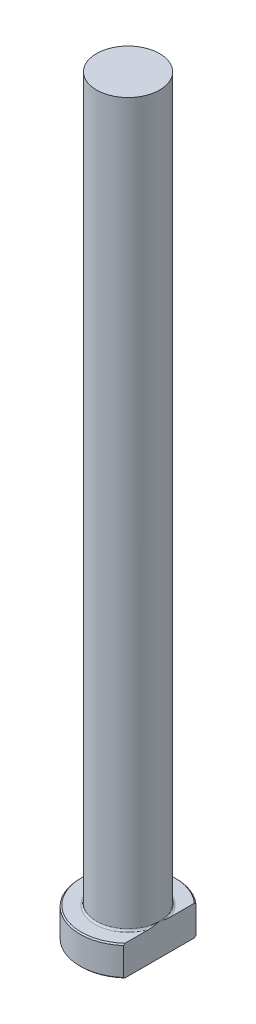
from build123d import *
from build123d.topology import SkipClean

# Parameters (mm, degrees)
CHAMFER1_SIZE = 0.2
FILLET1_R     = 0.3
KEY_DEPTH     = 126.510955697


with BuildPart() as part:
    # Sketch1 → Revolve1 (revolve)
    with BuildSketch(Plane.XY, mode=Mode.PRIVATE) as revolve1_sk:
        Polygon((0, 0), (-8, 0), (-8, 5), (-5.25, 5), (-5.25, 125), (0, 125), align=None)
    revolve(revolve1_sk.sketch.rotate(Axis((0, 259.958771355, 0), (0, -1, 0)), 270), axis=Axis((0, 259.958771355, 0), (0, -1, 0)))

    # Chamfer1
    chamfer1_edges = [part.edges().sort_by_distance(p)[0] for p in [
        (0, 5, -8),
        (0, 0, -8),
    ]]
    chamfer(chamfer1_edges, length=CHAMFER1_SIZE)

    # Fillet1
    fillet1_edges = [part.edges().sort_by_distance(p)[0] for p in [
        (0, 5, -5.25),
    ]]
    fillet(fillet1_edges, radius=FILLET1_R)

    # Sketch2 → KEY (cut, through all)
    with SkipClean():  # the faces are left unmerged after this step: merging them gives an invalid solid
        with BuildSketch(Plane(origin=(0, 0, 0), x_dir=(1, 0, 0), z_dir=(0, 1, 0))):
            with BuildLine():
                Line((5.25, 6.036348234), (5.25, -6.036348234))
                ThreePointArc((5.25, -6.036348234), (8, 0), (5.25, 6.036348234))
            make_face()
        extrude(amount=KEY_DEPTH, mode=Mode.SUBTRACT)


solid = part.part
